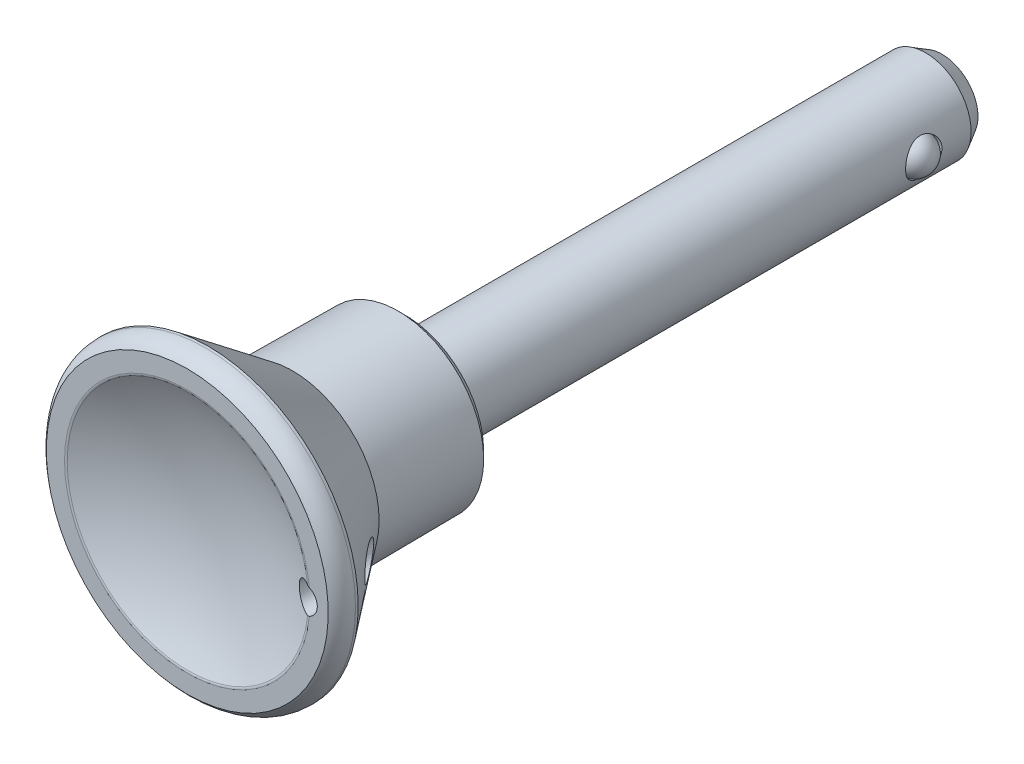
ISO-10303-21;
HEADER;
FILE_DESCRIPTION(('STEP AP214'),'2;1');
FILE_NAME('part.step','',(''),(''),'','','');
FILE_SCHEMA(('AUTOMOTIVE_DESIGN { 1 0 10303 214 1 1 1 1 }'));
ENDSEC;
DATA;
#1=APPLICATION_CONTEXT('core data for automotive mechanical design processes');
#2=APPLICATION_PROTOCOL_DEFINITION('international standard','automotive_design',2000,#1);
#3=PRODUCT_CONTEXT('',#1,'mechanical');
#4=PRODUCT('Part','Part','',(#3));
#5=PRODUCT_RELATED_PRODUCT_CATEGORY('part','',(#4));
#6=PRODUCT_DEFINITION_FORMATION('','',#4);
#7=PRODUCT_DEFINITION_CONTEXT('part definition',#1,'design');
#8=PRODUCT_DEFINITION('design','',#6,#7);
#9=PRODUCT_DEFINITION_SHAPE('','',#8);
#10=(LENGTH_UNIT() NAMED_UNIT(*) SI_UNIT(.MILLI.,.METRE.));
#11=(NAMED_UNIT(*) PLANE_ANGLE_UNIT() SI_UNIT($,.RADIAN.));
#12=(NAMED_UNIT(*) SI_UNIT($,.STERADIAN.) SOLID_ANGLE_UNIT());
#13=UNCERTAINTY_MEASURE_WITH_UNIT(LENGTH_MEASURE(1.E-05),#10,'distance_accuracy_value','');
#14=(GEOMETRIC_REPRESENTATION_CONTEXT(3) GLOBAL_UNCERTAINTY_ASSIGNED_CONTEXT((#13)) GLOBAL_UNIT_ASSIGNED_CONTEXT((#10,
#11,#12)) REPRESENTATION_CONTEXT('',''));
#15=CARTESIAN_POINT('',(0.,0.,0.));
#16=DIRECTION('',(0.,0.,1.));
#17=DIRECTION('',(1.,0.,0.));
#18=AXIS2_PLACEMENT_3D('',#15,#16,#17);
#19=CARTESIAN_POINT('',(0.,0.,23.5));
#20=DIRECTION('',(0.,0.,1.));
#21=DIRECTION('',(0.,-1.,0.));
#22=AXIS2_PLACEMENT_3D('',#19,#20,#21);
#23=TOROIDAL_SURFACE('',#22,13.4996296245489,0.50000000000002);
#24=CARTESIAN_POINT('',(13.1832697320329,1.45020836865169,23.940350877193));
#25=CARTESIAN_POINT('',(13.1967898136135,1.44663630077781,23.9473693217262));
#26=CARTESIAN_POINT('',(13.2105528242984,1.44279517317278,23.9537540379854));
#27=CARTESIAN_POINT('',(13.2384329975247,1.43456873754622,23.9652617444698));
#28=CARTESIAN_POINT('',(13.2525500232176,1.43018363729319,23.9703852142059));
#29=CARTESIAN_POINT('',(13.294658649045,1.41639274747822,23.9836925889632));
#30=CARTESIAN_POINT('',(13.322980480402,1.40620303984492,23.9901034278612));
#31=CARTESIAN_POINT('',(13.3645007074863,1.38980064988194,23.9961744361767));
#32=CARTESIAN_POINT('',(13.377775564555,1.38433480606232,23.9976116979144));
#33=CARTESIAN_POINT('',(13.4043485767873,1.37294329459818,23.9995283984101));
#34=CARTESIAN_POINT('',(13.4176457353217,1.3670137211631,23.999998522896));
#35=CARTESIAN_POINT('',(13.430859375,1.3608881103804,24.));
#36=B_SPLINE_CURVE_WITH_KNOTS('',3,(#24,#25,#26,#27,#28,#29,#30,#31,#32,#33,#34,#35),
.UNSPECIFIED.,.F.,.F.,(4,2,2,2,2,4),(0.,0.0468986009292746,0.0937793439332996,0.185591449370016,
0.228845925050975,0.272515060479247),.UNSPECIFIED.);
#37=CARTESIAN_POINT('',(13.1832697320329,1.45020836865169,23.940350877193));
#38=VERTEX_POINT('',#37);
#39=CARTESIAN_POINT('',(13.430859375,1.36088811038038,24.));
#40=VERTEX_POINT('',#39);
#41=EDGE_CURVE('E60',#38,#40,#36,.T.);
#42=ORIENTED_EDGE('',*,*,#41,.T.);
#43=CARTESIAN_POINT('',(0.,0.,24.));
#44=DIRECTION('',(0.,0.,1.));
#45=DIRECTION('',(0.,-1.,0.));
#46=AXIS2_PLACEMENT_3D('',#43,#44,#45);
#47=CIRCLE('',#46,13.499629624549);
#48=CARTESIAN_POINT('',(13.430859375,-1.36088811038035,24.));
#49=VERTEX_POINT('',#48);
#50=EDGE_CURVE('E39',#49,#40,#47,.F.);
#51=ORIENTED_EDGE('',*,*,#50,.F.);
#52=CARTESIAN_POINT('',(13.430859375,-1.36088811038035,24.));
#53=CARTESIAN_POINT('',(13.4166665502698,-1.36746807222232,23.9999984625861));
#54=CARTESIAN_POINT('',(13.4023759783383,-1.37382175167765,23.9994558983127));
#55=CARTESIAN_POINT('',(13.3736641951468,-1.38605678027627,23.9972288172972));
#56=CARTESIAN_POINT('',(13.3592428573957,-1.39193760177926,23.9955430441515));
#57=CARTESIAN_POINT('',(13.316571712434,-1.4085689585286,23.9887845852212));
#58=CARTESIAN_POINT('',(13.2882736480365,-1.41860415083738,23.9820148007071));
#59=CARTESIAN_POINT('',(13.2473798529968,-1.43179699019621,23.9685266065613));
#60=CARTESIAN_POINT('',(13.2344037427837,-1.43578270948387,23.9636790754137));
#61=CARTESIAN_POINT('',(13.2086362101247,-1.44332889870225,23.9528611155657));
#62=CARTESIAN_POINT('',(13.1958479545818,-1.44688469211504,23.9468798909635));
#63=CARTESIAN_POINT('',(13.1832697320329,-1.45020836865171,23.940350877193));
#64=B_SPLINE_CURVE_WITH_KNOTS('',3,(#52,#53,#54,#55,#56,#57,#58,#59,#60,#61,#62,#63),
.UNSPECIFIED.,.F.,.F.,(4,2,2,2,2,4),(0.,0.0469051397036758,0.0938619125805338,0.185680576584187,
0.228880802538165,0.2725152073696),.UNSPECIFIED.);
#65=CARTESIAN_POINT('',(13.1832697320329,-1.4502083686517,23.940350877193));
#66=VERTEX_POINT('',#65);
#67=EDGE_CURVE('E20',#49,#66,#64,.T.);
#68=ORIENTED_EDGE('',*,*,#67,.T.);
#69=CARTESIAN_POINT('',(0.,0.,23.940350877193));
#70=DIRECTION('',(0.,0.,1.));
#71=DIRECTION('',(0.,-1.,0.));
#72=AXIS2_PLACEMENT_3D('',#69,#70,#71);
#73=CIRCLE('',#72,13.2627940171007);
#74=EDGE_CURVE('E54',#38,#66,#73,.T.);
#75=ORIENTED_EDGE('',*,*,#74,.F.);
#76=EDGE_LOOP('',(#42,#51,#68,#75));
#77=FACE_BOUND('',#76,.T.);
#78=ADVANCED_FACE('F15',(#77),#23,.T.);
#79=CARTESIAN_POINT('',(0.,0.,48.6));
#80=DIRECTION('',(0.,-1.,0.));
#81=DIRECTION('',(0.,0.,1.));
#82=AXIS2_PLACEMENT_3D('',#79,#80,#81);
#83=SPHERICAL_SURFACE('',#82,28.);
#84=CARTESIAN_POINT('',(13.1832697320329,1.45020836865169,23.940350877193));
#85=CARTESIAN_POINT('',(13.0915993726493,1.4744532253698,23.8927620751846));
#86=CARTESIAN_POINT('',(12.9980560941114,1.489860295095,23.8443501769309));
#87=CARTESIAN_POINT('',(12.8097591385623,1.50293318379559,23.7471842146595));
#88=CARTESIAN_POINT('',(12.7150040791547,1.50057651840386,23.6984297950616));
#89=CARTESIAN_POINT('',(12.5270201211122,1.47798913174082,23.6019874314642));
#90=CARTESIAN_POINT('',(12.4337919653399,1.45774995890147,23.5543000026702));
#91=CARTESIAN_POINT('',(12.2517517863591,1.39948117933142,23.4614379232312));
#92=CARTESIAN_POINT('',(12.1629377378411,1.36145981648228,23.416262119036));
#93=CARTESIAN_POINT('',(11.9952411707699,1.26934990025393,23.3311736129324));
#94=CARTESIAN_POINT('',(11.9161458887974,1.21575714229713,23.2911465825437));
#95=CARTESIAN_POINT('',(11.7681643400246,1.09295087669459,23.2164149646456));
#96=CARTESIAN_POINT('',(11.6992729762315,1.02374521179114,23.1817077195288));
#97=CARTESIAN_POINT('',(11.5811025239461,0.878735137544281,23.1222729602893));
#98=CARTESIAN_POINT('',(11.5305709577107,0.804216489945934,23.0969048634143));
#99=CARTESIAN_POINT('',(11.4431131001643,0.645771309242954,23.0530473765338));
#100=CARTESIAN_POINT('',(11.4061726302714,0.561854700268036,23.0345508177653));
#101=CARTESIAN_POINT('',(11.3518094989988,0.398913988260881,23.0073479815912));
#102=CARTESIAN_POINT('',(11.332464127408,0.320688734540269,22.9976766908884));
#103=CARTESIAN_POINT('',(11.3065630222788,0.161638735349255,22.9847305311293));
#104=CARTESIAN_POINT('',(11.3000015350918,0.0808151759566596,22.9814527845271));
#105=CARTESIAN_POINT('',(11.2999985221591,-0.0778011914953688,22.9814513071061));
#106=CARTESIAN_POINT('',(11.3060768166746,-0.155594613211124,22.9844877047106));
#107=CARTESIAN_POINT('',(11.3300927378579,-0.308850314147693,22.9964912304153));
#108=CARTESIAN_POINT('',(11.3480306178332,-0.384312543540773,23.0054584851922));
#109=CARTESIAN_POINT('',(11.3948947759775,-0.530632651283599,23.0289063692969));
#110=CARTESIAN_POINT('',(11.4237977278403,-0.601499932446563,23.0433752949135));
#111=CARTESIAN_POINT('',(11.4913996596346,-0.737094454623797,23.0772561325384));
#112=CARTESIAN_POINT('',(11.5301003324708,-0.801820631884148,23.0966688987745));
#113=CARTESIAN_POINT('',(11.6176766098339,-0.926360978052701,23.1406602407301));
#114=CARTESIAN_POINT('',(11.6669073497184,-0.985860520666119,23.1654195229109));
#115=CARTESIAN_POINT('',(11.7728262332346,-1.09578522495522,23.2187793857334));
#116=CARTESIAN_POINT('',(11.8295165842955,-1.14620769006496,23.2473811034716));
#117=CARTESIAN_POINT('',(11.9547131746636,-1.24189507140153,23.3106654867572));
#118=CARTESIAN_POINT('',(12.0238340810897,-1.28614058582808,23.3456702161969));
#119=CARTESIAN_POINT('',(12.1672246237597,-1.36242212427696,23.4184517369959));
#120=CARTESIAN_POINT('',(12.2414976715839,-1.39444996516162,23.4562303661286));
#121=CARTESIAN_POINT('',(12.3592920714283,-1.4344825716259,23.5162885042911));
#122=CARTESIAN_POINT('',(12.4017101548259,-1.44682505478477,23.5379430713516));
#123=CARTESIAN_POINT('',(12.4872184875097,-1.4676864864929,23.5816530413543));
#124=CARTESIAN_POINT('',(12.5303081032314,-1.47620883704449,23.603708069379));
#125=CARTESIAN_POINT('',(12.6602504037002,-1.49604024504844,23.6703078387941));
#126=CARTESIAN_POINT('',(12.7478240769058,-1.50162964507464,23.7153114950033));
#127=CARTESIAN_POINT('',(12.8938293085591,-1.49821627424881,23.7905484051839));
#128=CARTESIAN_POINT('',(12.9524047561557,-1.49339577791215,23.8207882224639));
#129=CARTESIAN_POINT('',(13.0686394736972,-1.47691090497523,23.8809033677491));
#130=CARTESIAN_POINT('',(13.1263001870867,-1.46525870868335,23.9107792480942));
#131=CARTESIAN_POINT('',(13.1832697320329,-1.4502083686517,23.9403508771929));
#132=B_SPLINE_CURVE_WITH_KNOTS('',3,(#84,#85,#86,#87,#88,#89,#90,#91,#92,#93,#94,#95,#96,#97,
#98,#99,#100,#101,#102,#103,#104,#105,#106,#107,#108,#109,#110,#111,#112,#113,#114,#115,#116,
#117,#118,#119,#120,#121,#122,#123,#124,#125,#126,#127,#128,#129,#130,#131),.UNSPECIFIED.,.F.,
.F.,(4,2,2,2,2,2,2,2,2,2,2,2,2,2,2,2,2,2,2,2,2,2,2,4),(0.,0.317865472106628,0.636133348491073,
0.954551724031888,1.27282262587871,1.58190076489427,1.89082399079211,2.16986616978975,
2.44861641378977,2.69085568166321,2.93298589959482,3.16608592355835,3.39919092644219,
3.63180279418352,3.8644548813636,4.10674626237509,4.34910950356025,4.61569988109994,
4.88246850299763,5.02992533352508,5.17725058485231,5.4717357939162,5.66970066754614,
5.86731365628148),.UNSPECIFIED.);
#133=EDGE_CURVE('E50',#38,#66,#132,.T.);
#134=ORIENTED_EDGE('',*,*,#133,.F.);
#135=ORIENTED_EDGE('',*,*,#74,.T.);
#136=EDGE_LOOP('',(#134,#135));
#137=FACE_BOUND('',#136,.T.);
#138=ADVANCED_FACE('F52',(#137),#83,.F.);
#139=CARTESIAN_POINT('',(-15.81,-15.5,24.));
#140=CARTESIAN_POINT('',(-15.5,-15.5,24.));
#141=CARTESIAN_POINT('',(15.5,-15.5,24.));
#142=B_SPLINE_CURVE_WITH_KNOTS('',1,(#139,#140,#141),.UNSPECIFIED.,.F.,.F.,(2,1,2),(-0.01,0.,
1.),.UNSPECIFIED.);
#143=DIRECTION('',(0.,1.,0.));
#144=VECTOR('',#143,1.);
#145=SURFACE_OF_LINEAR_EXTRUSION('',#142,#144);
#146=CARTESIAN_POINT('',(12.8,0.,24.));
#147=DIRECTION('',(0.,0.,1.));
#148=DIRECTION('',(0.,-1.,0.));
#149=AXIS2_PLACEMENT_3D('',#146,#147,#148);
#150=CIRCLE('',#149,1.5);
#151=EDGE_CURVE('E57',#49,#40,#150,.T.);
#152=ORIENTED_EDGE('',*,*,#151,.F.);
#153=ORIENTED_EDGE('',*,*,#50,.T.);
#154=EDGE_LOOP('',(#152,#153));
#155=FACE_BOUND('',#154,.T.);
#156=CARTESIAN_POINT('',(0.,0.,24.));
#157=DIRECTION('',(0.,0.,1.));
#158=DIRECTION('',(0.,-1.,0.));
#159=AXIS2_PLACEMENT_3D('',#156,#157,#158);
#160=CIRCLE('',#159,15.5);
#161=CARTESIAN_POINT('',(0.,-15.5,24.));
#162=VERTEX_POINT('',#161);
#163=EDGE_CURVE('E58',#162,#162,#160,.F.);
#164=ORIENTED_EDGE('',*,*,#163,.F.);
#165=EDGE_LOOP('',(#164));
#166=FACE_BOUND('',#165,.T.);
#167=ADVANCED_FACE('F192',(#155,#166),#145,.T.);
#168=CARTESIAN_POINT('',(0.,0.,22.));
#169=DIRECTION('',(0.,0.,1.));
#170=DIRECTION('',(0.,-1.,0.));
#171=AXIS2_PLACEMENT_3D('',#168,#169,#170);
#172=TOROIDAL_SURFACE('',#171,14.,2.5);
#173=ORIENTED_EDGE('',*,*,#163,.T.);
#174=EDGE_LOOP('',(#173));
#175=FACE_BOUND('',#174,.T.);
#176=CARTESIAN_POINT('',(0.,0.,22.));
#177=DIRECTION('',(0.,0.,1.));
#178=DIRECTION('',(1.,0.,0.));
#179=AXIS2_PLACEMENT_3D('',#176,#177,#178);
#180=CIRCLE('',#179,16.5);
#181=CARTESIAN_POINT('',(16.5,0.,22.));
#182=VERTEX_POINT('',#181);
#183=EDGE_CURVE('E101',#182,#182,#180,.F.);
#184=ORIENTED_EDGE('',*,*,#183,.F.);
#185=EDGE_LOOP('',(#184));
#186=FACE_BOUND('',#185,.T.);
#187=ADVANCED_FACE('F79',(#175,#186),#172,.T.);
#188=CARTESIAN_POINT('',(12.8,0.,14.7910576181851));
#189=DIRECTION('',(0.,0.,1.));
#190=DIRECTION('',(0.,-1.,0.));
#191=AXIS2_PLACEMENT_3D('',#188,#189,#190);
#192=CYLINDRICAL_SURFACE('',#191,1.5);
#193=CARTESIAN_POINT('',(12.62421875,-1.48966471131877,16.6671130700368));
#194=CARTESIAN_POINT('',(12.6920032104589,-1.49766166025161,16.7577945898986));
#195=CARTESIAN_POINT('',(12.7603283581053,-1.50104579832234,16.8484671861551));
#196=CARTESIAN_POINT('',(12.897645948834,-1.49839397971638,17.0292601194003));
#197=CARTESIAN_POINT('',(12.9666387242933,-1.49235306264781,17.1193801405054));
#198=CARTESIAN_POINT('',(13.1046564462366,-1.47039580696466,17.2982798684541));
#199=CARTESIAN_POINT('',(13.1736813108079,-1.45448817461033,17.3870606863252));
#200=CARTESIAN_POINT('',(13.3110827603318,-1.41207641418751,17.5624849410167));
#201=CARTESIAN_POINT('',(13.3794598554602,-1.38558148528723,17.6491301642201));
#202=CARTESIAN_POINT('',(13.5187485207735,-1.31898430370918,17.8243946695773));
#203=CARTESIAN_POINT('',(13.5895656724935,-1.27816038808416,17.9128199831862));
#204=CARTESIAN_POINT('',(13.7277317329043,-1.18169522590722,18.084148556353));
#205=CARTESIAN_POINT('',(13.7950853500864,-1.12607476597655,18.1670593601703));
#206=CARTESIAN_POINT('',(13.9084086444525,-1.01303116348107,18.3057043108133));
#207=CARTESIAN_POINT('',(13.9556726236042,-0.959133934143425,18.3632332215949));
#208=CARTESIAN_POINT('',(14.0446143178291,-0.840483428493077,18.471045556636));
#209=CARTESIAN_POINT('',(14.0863013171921,-0.775748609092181,18.5213410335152));
#210=CARTESIAN_POINT('',(14.1507925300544,-0.654717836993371,18.5988956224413));
#211=CARTESIAN_POINT('',(14.1756178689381,-0.601120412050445,18.6286642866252));
#212=CARTESIAN_POINT('',(14.2195452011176,-0.488403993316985,18.6812412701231));
#213=CARTESIAN_POINT('',(14.238652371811,-0.429290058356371,18.7040558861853));
#214=CARTESIAN_POINT('',(14.2689681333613,-0.309460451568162,18.7402118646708));
#215=CARTESIAN_POINT('',(14.2805052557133,-0.248950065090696,18.7539474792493));
#216=CARTESIAN_POINT('',(14.2960184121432,-0.12562551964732,18.77240966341));
#217=CARTESIAN_POINT('',(14.3000000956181,-0.0628131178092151,18.7771429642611));
#218=CARTESIAN_POINT('',(14.2999999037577,0.0632231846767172,18.7771427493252));
#219=CARTESIAN_POINT('',(14.2959658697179,0.126447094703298,18.7723472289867));
#220=CARTESIAN_POINT('',(14.2802519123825,0.250551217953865,18.7536458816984));
#221=CARTESIAN_POINT('',(14.2685662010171,0.311429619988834,18.7397331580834));
#222=CARTESIAN_POINT('',(14.2387365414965,0.428564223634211,18.7041556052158));
#223=CARTESIAN_POINT('',(14.2206451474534,0.484853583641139,18.6825538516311));
#224=CARTESIAN_POINT('',(14.1792492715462,0.592453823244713,18.633014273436));
#225=CARTESIAN_POINT('',(14.1559422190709,0.643762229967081,18.6050733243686));
#226=CARTESIAN_POINT('',(14.0931329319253,0.764461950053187,18.5295741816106));
#227=CARTESIAN_POINT('',(14.0512237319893,0.830727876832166,18.4790335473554));
#228=CARTESIAN_POINT('',(13.9615408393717,0.952125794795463,18.370367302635));
#229=CARTESIAN_POINT('',(13.9137529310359,1.00722990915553,18.3122232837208));
#230=CARTESIAN_POINT('',(13.7883270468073,1.13348006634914,18.1588182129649));
#231=CARTESIAN_POINT('',(13.708179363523,1.1978805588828,18.0600849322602));
#232=CARTESIAN_POINT('',(13.5435609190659,1.3064664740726,17.8554996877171));
#233=CARTESIAN_POINT('',(13.4590828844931,1.35061655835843,17.7496356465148));
#234=CARTESIAN_POINT('',(13.3107013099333,1.41202717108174,17.5619635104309));
#235=CARTESIAN_POINT('',(13.2471965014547,1.43330058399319,17.4811068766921));
#236=CARTESIAN_POINT('',(13.1198264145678,1.46698834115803,17.3177942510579));
#237=CARTESIAN_POINT('',(13.0559609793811,1.47939847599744,17.2353375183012));
#238=CARTESIAN_POINT('',(12.9282718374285,1.49589397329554,17.0692879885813));
#239=CARTESIAN_POINT('',(12.8644485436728,1.49996064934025,16.9856930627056));
#240=CARTESIAN_POINT('',(12.7374091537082,1.50003877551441,16.8180712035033));
#241=CARTESIAN_POINT('',(12.6741929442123,1.49605175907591,16.7340443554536));
#242=CARTESIAN_POINT('',(12.5469978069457,1.47993658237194,16.5637117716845));
#243=CARTESIAN_POINT('',(12.4830456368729,1.46758777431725,16.4774068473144));
#244=CARTESIAN_POINT('',(12.3565302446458,1.43443826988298,16.3053467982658));
#245=CARTESIAN_POINT('',(12.2939675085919,1.41363466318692,16.2195918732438));
#246=CARTESIAN_POINT('',(12.1709555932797,1.36334219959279,16.0496685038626));
#247=CARTESIAN_POINT('',(12.1104987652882,1.33388949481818,15.9654949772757));
#248=CARTESIAN_POINT('',(11.9920388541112,1.26565016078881,15.7992974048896));
#249=CARTESIAN_POINT('',(11.9340336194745,1.22687192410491,15.7172714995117));
#250=CARTESIAN_POINT('',(11.8266654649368,1.14315320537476,15.5643050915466));
#251=CARTESIAN_POINT('',(11.7770073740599,1.09916121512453,15.4930561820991));
#252=CARTESIAN_POINT('',(11.6811267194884,1.0014126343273,15.3545942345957));
#253=CARTESIAN_POINT('',(11.6349116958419,0.947635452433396,15.2873901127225));
#254=CARTESIAN_POINT('',(11.5691423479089,0.858125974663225,15.1911821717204));
#255=CARTESIAN_POINT('',(11.5476572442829,0.826531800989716,15.1596504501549));
#256=CARTESIAN_POINT('',(11.5063433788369,0.760253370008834,15.0988444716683));
#257=CARTESIAN_POINT('',(11.4865152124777,0.725568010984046,15.0695710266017));
#258=CARTESIAN_POINT('',(11.4302732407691,0.616814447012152,14.9863165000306));
#259=CARTESIAN_POINT('',(11.3967954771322,0.537651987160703,14.9364517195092));
#260=CARTESIAN_POINT('',(11.3555291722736,0.407099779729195,14.8747804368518));
#261=CARTESIAN_POINT('',(11.3430899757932,0.360365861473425,14.856144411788));
#262=CARTESIAN_POINT('',(11.3225831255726,0.263914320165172,14.8253840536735));
#263=CARTESIAN_POINT('',(11.3145046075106,0.214204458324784,14.8132435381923));
#264=CARTESIAN_POINT('',(11.3059949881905,0.136701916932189,14.8004485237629));
#265=CARTESIAN_POINT('',(11.3037543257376,0.109528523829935,14.7970776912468));
#266=CARTESIAN_POINT('',(11.300755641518,0.0549082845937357,14.7925658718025));
#267=CARTESIAN_POINT('',(11.2999979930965,0.0274613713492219,14.791425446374));
#268=CARTESIAN_POINT('',(11.3000036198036,-0.049531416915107,14.7914342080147));
#269=CARTESIAN_POINT('',(11.3024785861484,-0.0991098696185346,14.7951600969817));
#270=CARTESIAN_POINT('',(11.3121472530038,-0.196763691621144,14.8096998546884));
#271=CARTESIAN_POINT('',(11.3193489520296,-0.244836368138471,14.8205257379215));
#272=CARTESIAN_POINT('',(11.3399096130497,-0.348584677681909,14.8513795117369));
#273=CARTESIAN_POINT('',(11.3542736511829,-0.403610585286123,14.872906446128));
#274=CARTESIAN_POINT('',(11.387815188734,-0.508718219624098,14.9230284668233));
#275=CARTESIAN_POINT('',(11.4070004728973,-0.558791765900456,14.9516349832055));
#276=CARTESIAN_POINT('',(11.4595328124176,-0.677671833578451,15.0296959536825));
#277=CARTESIAN_POINT('',(11.4951602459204,-0.743300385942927,15.0824162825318));
#278=CARTESIAN_POINT('',(11.5718624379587,-0.864190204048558,15.1952386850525));
#279=CARTESIAN_POINT('',(11.6129512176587,-0.919423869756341,15.2553597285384));
#280=CARTESIAN_POINT('',(11.6921657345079,-1.01283475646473,15.3705343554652));
#281=CARTESIAN_POINT('',(11.7297508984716,-1.05232856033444,15.4249113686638));
#282=CARTESIAN_POINT('',(11.8070065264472,-1.12552131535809,15.5360737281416));
#283=CARTESIAN_POINT('',(11.8466784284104,-1.15921620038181,15.5928607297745));
#284=CARTESIAN_POINT('',(11.9276586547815,-1.22132048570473,15.7081342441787));
#285=CARTESIAN_POINT('',(11.9689673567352,-1.24972865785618,15.7666211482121));
#286=CARTESIAN_POINT('',(12.0529136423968,-1.30165144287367,15.884812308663));
#287=CARTESIAN_POINT('',(12.0955516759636,-1.32516437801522,15.9445169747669));
#288=CARTESIAN_POINT('',(12.2167649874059,-1.38470455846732,16.1132939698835));
#289=CARTESIAN_POINT('',(12.2965837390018,-1.41552588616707,16.2233378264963));
#290=CARTESIAN_POINT('',(12.458735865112,-1.46310486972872,16.4446295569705));
#291=CARTESIAN_POINT('',(12.5410705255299,-1.47985520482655,16.5558780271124));
#292=CARTESIAN_POINT('',(12.62421875,-1.48966471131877,16.6671130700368));
#293=B_SPLINE_CURVE_WITH_KNOTS('',3,(#193,#194,#195,#196,#197,#198,#199,#200,#201,#202,#203,
#204,#205,#206,#207,#208,#209,#210,#211,#212,#213,#214,#215,#216,#217,#218,#219,#220,#221,#222,
#223,#224,#225,#226,#227,#228,#229,#230,#231,#232,#233,#234,#235,#236,#237,#238,#239,#240,#241,
#242,#243,#244,#245,#246,#247,#248,#249,#250,#251,#252,#253,#254,#255,#256,#257,#258,#259,#260,
#261,#262,#263,#264,#265,#266,#267,#268,#269,#270,#271,#272,#273,#274,#275,#276,#277,#278,#279,
#280,#281,#282,#283,#284,#285,#286,#287,#288,#289,#290,#291,#292),.UNSPECIFIED.,.T.,.F.,(4,2,2,
2,2,2,2,2,2,2,2,2,2,2,2,2,2,2,2,2,2,2,2,2,2,2,2,2,2,2,2,2,2,2,2,2,2,2,2,2,2,2,2,2,2,2,2,2,2,4),
(0.,0.3403810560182,0.680941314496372,1.02120149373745,1.36116666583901,1.72154948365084,
2.08142867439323,2.35634247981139,2.63079277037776,2.82853330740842,3.02609425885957,
3.21438583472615,3.40253656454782,3.59191561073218,3.78143807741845,3.96944036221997,
4.15753551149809,4.43581804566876,4.71478725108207,5.14007838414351,5.56610888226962,
5.88069336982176,6.19542716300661,6.51086508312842,6.82624294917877,7.15028500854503,
7.47443870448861,7.79725631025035,8.11978447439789,8.41136093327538,8.70355821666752,
8.8520054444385,9.00050579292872,9.29551066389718,9.45047012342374,9.60504170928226,
9.6873437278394,9.76966646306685,9.91815000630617,10.0668854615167,10.2482950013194,
10.4299993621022,10.7027068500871,10.9761285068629,11.2068168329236,11.4376662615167,
11.6685692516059,11.8995512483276,12.3168647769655,12.7343952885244),.UNSPECIFIED.);
#294=CARTESIAN_POINT('',(12.62421875,-1.48966471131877,16.6671130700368));
#295=VERTEX_POINT('',#294);
#296=EDGE_CURVE('E93',#295,#295,#293,.T.);
#297=ORIENTED_EDGE('',*,*,#296,.F.);
#298=EDGE_LOOP('',(#297));
#299=FACE_BOUND('',#298,.T.);
#300=ORIENTED_EDGE('',*,*,#67,.F.);
#301=ORIENTED_EDGE('',*,*,#151,.T.);
#302=ORIENTED_EDGE('',*,*,#41,.F.);
#303=ORIENTED_EDGE('',*,*,#133,.T.);
#304=EDGE_LOOP('',(#300,#301,#302,#303));
#305=FACE_BOUND('',#304,.T.);
#306=ADVANCED_FACE('F61',(#299,#305),#192,.F.);
#307=CARTESIAN_POINT('',(0.,0.,22.));
#308=DIRECTION('',(0.,0.,1.));
#309=DIRECTION('',(0.,-1.,0.));
#310=AXIS2_PLACEMENT_3D('',#307,#308,#309);
#311=CYLINDRICAL_SURFACE('',#310,16.5);
#312=ORIENTED_EDGE('',*,*,#183,.T.);
#313=EDGE_LOOP('',(#312));
#314=FACE_BOUND('',#313,.T.);
#315=CARTESIAN_POINT('',(0.,0.,21.7));
#316=DIRECTION('',(0.,0.,-1.));
#317=DIRECTION('',(1.,0.,0.));
#318=AXIS2_PLACEMENT_3D('',#315,#316,#317);
#319=CIRCLE('',#318,16.5);
#320=CARTESIAN_POINT('',(16.5,0.,21.7));
#321=VERTEX_POINT('',#320);
#322=EDGE_CURVE('E100',#321,#321,#319,.T.);
#323=ORIENTED_EDGE('',*,*,#322,.F.);
#324=EDGE_LOOP('',(#323));
#325=FACE_BOUND('',#324,.T.);
#326=ADVANCED_FACE('F78',(#314,#325),#311,.T.);
#327=CARTESIAN_POINT('',(0.,0.,12.4));
#328=DIRECTION('',(0.,0.,1.));
#329=DIRECTION('',(0.,-1.,0.));
#330=AXIS2_PLACEMENT_3D('',#327,#328,#329);
#331=CONICAL_SURFACE('',#330,9.5,0.645219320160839);
#332=ORIENTED_EDGE('',*,*,#296,.T.);
#333=EDGE_LOOP('',(#332));
#334=FACE_BOUND('',#333,.T.);
#335=ORIENTED_EDGE('',*,*,#322,.T.);
#336=EDGE_LOOP('',(#335));
#337=FACE_BOUND('',#336,.T.);
#338=CARTESIAN_POINT('',(0.,0.,12.4));
#339=DIRECTION('',(0.,0.,-1.));
#340=DIRECTION('',(1.,0.,0.));
#341=AXIS2_PLACEMENT_3D('',#338,#339,#340);
#342=CIRCLE('',#341,9.5);
#343=CARTESIAN_POINT('',(9.5,0.,12.4));
#344=VERTEX_POINT('',#343);
#345=EDGE_CURVE('E173',#344,#344,#342,.T.);
#346=ORIENTED_EDGE('',*,*,#345,.F.);
#347=EDGE_LOOP('',(#346));
#348=FACE_BOUND('',#347,.T.);
#349=ADVANCED_FACE('F102',(#334,#337,#348),#331,.T.);
#350=CARTESIAN_POINT('',(0.,0.,0.799969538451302));
#351=DIRECTION('',(0.,0.,1.));
#352=DIRECTION('',(0.,-1.,0.));
#353=AXIS2_PLACEMENT_3D('',#350,#351,#352);
#354=CONICAL_SURFACE('',#353,9.39876806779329,0.00872664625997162);
#355=ORIENTED_EDGE('',*,*,#345,.T.);
#356=EDGE_LOOP('',(#355));
#357=FACE_BOUND('',#356,.T.);
#358=CARTESIAN_POINT('',(0.,0.,0.799969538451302));
#359=DIRECTION('',(0.,0.,-1.));
#360=DIRECTION('',(1.,0.,0.));
#361=AXIS2_PLACEMENT_3D('',#358,#359,#360);
#362=CIRCLE('',#361,9.39876806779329);
#363=CARTESIAN_POINT('',(9.39876806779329,0.,0.799969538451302));
#364=VERTEX_POINT('',#363);
#365=EDGE_CURVE('E169',#364,#364,#362,.T.);
#366=ORIENTED_EDGE('',*,*,#365,.F.);
#367=EDGE_LOOP('',(#366));
#368=FACE_BOUND('',#367,.T.);
#369=ADVANCED_FACE('F106',(#357,#368),#354,.T.);
#370=CARTESIAN_POINT('',(0.,0.,0.));
#371=DIRECTION('',(0.,0.,1.));
#372=DIRECTION('',(0.,-1.,0.));
#373=AXIS2_PLACEMENT_3D('',#370,#371,#372);
#374=CONICAL_SURFACE('',#373,8.59178683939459,0.789761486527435);
#375=ORIENTED_EDGE('',*,*,#365,.T.);
#376=EDGE_LOOP('',(#375));
#377=FACE_BOUND('',#376,.T.);
#378=CARTESIAN_POINT('',(0.,0.,0.));
#379=DIRECTION('',(0.,0.,1.));
#380=DIRECTION('',(0.,-1.,0.));
#381=AXIS2_PLACEMENT_3D('',#378,#379,#380);
#382=CIRCLE('',#381,8.59178683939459);
#383=CARTESIAN_POINT('',(0.,-8.59178683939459,0.));
#384=VERTEX_POINT('',#383);
#385=EDGE_CURVE('E32',#384,#384,#382,.F.);
#386=ORIENTED_EDGE('',*,*,#385,.F.);
#387=EDGE_LOOP('',(#386));
#388=FACE_BOUND('',#387,.T.);
#389=ADVANCED_FACE('F110',(#377,#388),#374,.T.);
#390=CARTESIAN_POINT('',(8.5917868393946,-8.69489038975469,0.));
#391=DIRECTION('',(0.,0.,-1.));
#392=DIRECTION('',(-1.,0.,0.));
#393=AXIS2_PLACEMENT_3D('',#390,#391,#392);
#394=PLANE('',#393);
#395=CARTESIAN_POINT('',(0.,0.,0.));
#396=DIRECTION('',(0.,0.,1.));
#397=DIRECTION('',(0.,-1.,0.));
#398=AXIS2_PLACEMENT_3D('',#395,#396,#397);
#399=CIRCLE('',#398,5.);
#400=CARTESIAN_POINT('',(0.,-5.,0.));
#401=VERTEX_POINT('',#400);
#402=EDGE_CURVE('E9',#401,#401,#399,.F.);
#403=ORIENTED_EDGE('',*,*,#402,.F.);
#404=EDGE_LOOP('',(#403));
#405=FACE_BOUND('',#404,.T.);
#406=ORIENTED_EDGE('',*,*,#385,.T.);
#407=EDGE_LOOP('',(#406));
#408=FACE_BOUND('',#407,.T.);
#409=ADVANCED_FACE('F114',(#405,#408),#394,.T.);
#410=CARTESIAN_POINT('',(0.,0.,0.));
#411=DIRECTION('',(0.,0.,1.));
#412=DIRECTION('',(0.,-1.,0.));
#413=AXIS2_PLACEMENT_3D('',#410,#411,#412);
#414=CYLINDRICAL_SURFACE('',#413,5.);
#415=ORIENTED_EDGE('',*,*,#402,.T.);
#416=EDGE_LOOP('',(#415));
#417=FACE_BOUND('',#416,.T.);
#418=CARTESIAN_POINT('',(5.,0.,-50.));
#419=CARTESIAN_POINT('',(4.99999504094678,0.107615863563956,-50.0000062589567));
#420=CARTESIAN_POINT('',(4.99648897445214,0.215325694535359,-50.0087281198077));
#421=CARTESIAN_POINT('',(4.98282088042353,0.42761671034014,-50.0432818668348));
#422=CARTESIAN_POINT('',(4.97264930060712,0.532193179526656,-50.0691383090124));
#423=CARTESIAN_POINT('',(4.94674442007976,0.734940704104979,-50.1368701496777));
#424=CARTESIAN_POINT('',(4.93102668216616,0.833128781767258,-50.1787007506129));
#425=CARTESIAN_POINT('',(4.89557266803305,1.0210409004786,-50.2770003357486));
#426=CARTESIAN_POINT('',(4.87583644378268,1.11076505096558,-50.3334691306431));
#427=CARTESIAN_POINT('',(4.83330802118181,1.28350477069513,-50.4622380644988));
#428=CARTESIAN_POINT('',(4.8104211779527,1.36606882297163,-50.5351123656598));
#429=CARTESIAN_POINT('',(4.76460397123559,1.51818036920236,-50.6934066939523));
#430=CARTESIAN_POINT('',(4.74167359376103,1.58772251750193,-50.7788318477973));
#431=CARTESIAN_POINT('',(4.69722807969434,1.71487412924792,-50.9644273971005));
#432=CARTESIAN_POINT('',(4.67582146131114,1.77181418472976,-51.0650850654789));
#433=CARTESIAN_POINT('',(4.63833669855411,1.86775416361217,-51.2755348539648));
#434=CARTESIAN_POINT('',(4.62225609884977,1.90676235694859,-51.3853227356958));
#435=CARTESIAN_POINT('',(4.59826357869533,1.9638988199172,-51.6057123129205));
#436=CARTESIAN_POINT('',(4.59001420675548,1.9828939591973,-51.7160511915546));
#437=CARTESIAN_POINT('',(4.58164004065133,2.00217296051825,-51.9386349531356));
#438=CARTESIAN_POINT('',(4.5815112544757,2.00246601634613,-52.0508788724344));
#439=CARTESIAN_POINT('',(4.58910500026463,1.98498937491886,-52.2657566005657));
#440=CARTESIAN_POINT('',(4.59628174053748,1.96847534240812,-52.3685155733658));
#441=CARTESIAN_POINT('',(4.61676185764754,1.91994691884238,-52.5696594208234));
#442=CARTESIAN_POINT('',(4.63006631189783,1.88792980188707,-52.6680435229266));
#443=CARTESIAN_POINT('',(4.66159517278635,1.80869394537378,-52.8600197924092));
#444=CARTESIAN_POINT('',(4.67991453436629,1.76117802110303,-52.9534730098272));
#445=CARTESIAN_POINT('',(4.71938201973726,1.65250390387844,-53.1314192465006));
#446=CARTESIAN_POINT('',(4.74053109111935,1.59134113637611,-53.2159092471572));
#447=CARTESIAN_POINT('',(4.78526406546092,1.45156124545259,-53.3803975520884));
#448=CARTESIAN_POINT('',(4.80890991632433,1.37196139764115,-53.4595460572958));
#449=CARTESIAN_POINT('',(4.85459194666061,1.20033946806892,-53.6036660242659));
#450=CARTESIAN_POINT('',(4.87662734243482,1.10831139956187,-53.668630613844));
#451=CARTESIAN_POINT('',(4.91716230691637,0.912007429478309,-53.7836609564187));
#452=CARTESIAN_POINT('',(4.93558065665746,0.80752012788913,-53.8333960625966));
#453=CARTESIAN_POINT('',(4.96616672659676,0.590835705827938,-53.914216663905));
#454=CARTESIAN_POINT('',(4.97834697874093,0.478654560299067,-53.9453395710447));
#455=CARTESIAN_POINT('',(4.99108567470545,0.304486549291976,-53.977631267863));
#456=CARTESIAN_POINT('',(4.99441629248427,0.243952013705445,-53.9860060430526));
#457=CARTESIAN_POINT('',(4.99887485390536,0.122288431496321,-53.9971921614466));
#458=CARTESIAN_POINT('',(5.00000281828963,0.0611593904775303,-54.0000035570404));
#459=CARTESIAN_POINT('',(4.99999504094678,-0.107615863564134,-53.9999937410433));
#460=CARTESIAN_POINT('',(4.99648897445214,-0.215325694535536,-53.9912718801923));
#461=CARTESIAN_POINT('',(4.98282088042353,-0.427616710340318,-53.9567181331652));
#462=CARTESIAN_POINT('',(4.97264930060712,-0.532193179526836,-53.9308616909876));
#463=CARTESIAN_POINT('',(4.94674442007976,-0.734940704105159,-53.8631298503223));
#464=CARTESIAN_POINT('',(4.93102668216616,-0.833128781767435,-53.8212992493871));
#465=CARTESIAN_POINT('',(4.89557266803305,-1.02104090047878,-53.7229996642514));
#466=CARTESIAN_POINT('',(4.87583644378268,-1.11076505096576,-53.6665308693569));
#467=CARTESIAN_POINT('',(4.83330802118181,-1.28350477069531,-53.5377619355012));
#468=CARTESIAN_POINT('',(4.81042117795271,-1.3660688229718,-53.4648876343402));
#469=CARTESIAN_POINT('',(4.76460397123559,-1.51818036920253,-53.3065933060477));
#470=CARTESIAN_POINT('',(4.74167359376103,-1.58772251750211,-53.2211681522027));
#471=CARTESIAN_POINT('',(4.69722807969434,-1.7148741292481,-53.0355726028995));
#472=CARTESIAN_POINT('',(4.67582146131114,-1.77181418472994,-52.9349149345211));
#473=CARTESIAN_POINT('',(4.63833669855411,-1.86775416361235,-52.7244651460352));
#474=CARTESIAN_POINT('',(4.62225609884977,-1.90676235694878,-52.6146772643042));
#475=CARTESIAN_POINT('',(4.59826357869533,-1.96389881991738,-52.3942876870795));
#476=CARTESIAN_POINT('',(4.59001420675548,-1.98289395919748,-52.2839488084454));
#477=CARTESIAN_POINT('',(4.58164004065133,-2.00217296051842,-52.0613650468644));
#478=CARTESIAN_POINT('',(4.5815112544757,-2.0024660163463,-51.9491211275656));
#479=CARTESIAN_POINT('',(4.58910500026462,-1.98498937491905,-51.7342433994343));
#480=CARTESIAN_POINT('',(4.59628174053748,-1.96847534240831,-51.6314844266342));
#481=CARTESIAN_POINT('',(4.61676185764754,-1.91994691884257,-51.4303405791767));
#482=CARTESIAN_POINT('',(4.63006631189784,-1.88792980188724,-51.3319564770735));
#483=CARTESIAN_POINT('',(4.66159517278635,-1.80869394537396,-51.1399802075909));
#484=CARTESIAN_POINT('',(4.67991453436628,-1.76117802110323,-51.0465269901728));
#485=CARTESIAN_POINT('',(4.71938201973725,-1.65250390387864,-50.8685807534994));
#486=CARTESIAN_POINT('',(4.74053109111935,-1.5913411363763,-50.7840907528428));
#487=CARTESIAN_POINT('',(4.78526406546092,-1.45156124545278,-50.6196024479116));
#488=CARTESIAN_POINT('',(4.80890991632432,-1.37196139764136,-50.5404539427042));
#489=CARTESIAN_POINT('',(4.8545919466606,-1.20033946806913,-50.3963339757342));
#490=CARTESIAN_POINT('',(4.87662734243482,-1.10831139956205,-50.3313693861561));
#491=CARTESIAN_POINT('',(4.91716230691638,-0.912007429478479,-50.2163390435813));
#492=CARTESIAN_POINT('',(4.93558065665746,-0.80752012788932,-50.1666039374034));
#493=CARTESIAN_POINT('',(4.96616672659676,-0.590835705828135,-50.0857833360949));
#494=CARTESIAN_POINT('',(4.97834697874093,-0.478654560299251,-50.0546604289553));
#495=CARTESIAN_POINT('',(4.99108567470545,-0.304486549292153,-50.022368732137));
#496=CARTESIAN_POINT('',(4.99441629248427,-0.243952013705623,-50.0139939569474));
#497=CARTESIAN_POINT('',(4.99887485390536,-0.122288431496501,-50.0028078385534));
#498=CARTESIAN_POINT('',(5.00000281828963,-0.0611593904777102,-49.9999964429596));
#499=CARTESIAN_POINT('',(5.,0.,-50.));
#500=B_SPLINE_CURVE_WITH_KNOTS('',3,(#418,#419,#420,#421,#422,#423,#424,#425,#426,#427,#428,
#429,#430,#431,#432,#433,#434,#435,#436,#437,#438,#439,#440,#441,#442,#443,#444,#445,#446,#447,
#448,#449,#450,#451,#452,#453,#454,#455,#456,#457,#458,#459,#460,#461,#462,#463,#464,#465,#466,
#467,#468,#469,#470,#471,#472,#473,#474,#475,#476,#477,#478,#479,#480,#481,#482,#483,#484,#485,
#486,#487,#488,#489,#490,#491,#492,#493,#494,#495,#496,#497,#498,#499),.UNSPECIFIED.,.T.,.F.,(4,
2,2,2,2,2,2,2,2,2,2,2,2,2,2,2,2,2,2,2,2,2,2,2,2,2,2,2,2,2,2,2,2,2,2,2,2,2,2,2,4),(0.,
0.322610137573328,0.645683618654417,0.967857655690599,1.29002752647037,1.62598692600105,
1.9620839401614,2.31315011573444,2.6640542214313,2.99904097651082,3.33386305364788,
3.6453830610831,3.9569578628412,4.27489766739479,4.59294420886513,4.93553475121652,
5.27829091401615,5.62803295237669,5.97706959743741,6.16041454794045,6.34375777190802,
6.66636790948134,6.98944139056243,7.31161542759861,7.63378529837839,7.96974469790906,
8.30584171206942,8.65690788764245,9.00781199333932,9.34279874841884,9.6776208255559,
9.98914083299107,10.3007156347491,10.6186554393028,10.9367019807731,11.2792925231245,
11.6220486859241,11.9717907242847,12.3208273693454,12.5041723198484,12.687515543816),.UNSPECIFIED.);
#501=CARTESIAN_POINT('',(5.,0.,-50.));
#502=VERTEX_POINT('',#501);
#503=EDGE_CURVE('E131',#502,#502,#500,.T.);
#504=ORIENTED_EDGE('',*,*,#503,.T.);
#505=EDGE_LOOP('',(#504));
#506=FACE_BOUND('',#505,.T.);
#507=CARTESIAN_POINT('',(-5.,0.,-50.));
#508=CARTESIAN_POINT('',(-4.99999504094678,0.107615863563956,-50.0000062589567));
#509=CARTESIAN_POINT('',(-4.99648897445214,0.215325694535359,-50.0087281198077));
#510=CARTESIAN_POINT('',(-4.98282088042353,0.427616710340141,-50.0432818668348));
#511=CARTESIAN_POINT('',(-4.97264930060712,0.532193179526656,-50.0691383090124));
#512=CARTESIAN_POINT('',(-4.94674442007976,0.734940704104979,-50.1368701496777));
#513=CARTESIAN_POINT('',(-4.93102668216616,0.833128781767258,-50.1787007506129));
#514=CARTESIAN_POINT('',(-4.89557266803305,1.0210409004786,-50.2770003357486));
#515=CARTESIAN_POINT('',(-4.87583644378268,1.11076505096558,-50.3334691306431));
#516=CARTESIAN_POINT('',(-4.83330802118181,1.28350477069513,-50.4622380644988));
#517=CARTESIAN_POINT('',(-4.8104211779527,1.36606882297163,-50.5351123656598));
#518=CARTESIAN_POINT('',(-4.76460397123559,1.51818036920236,-50.6934066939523));
#519=CARTESIAN_POINT('',(-4.74167359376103,1.58772251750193,-50.7788318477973));
#520=CARTESIAN_POINT('',(-4.69722807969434,1.71487412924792,-50.9644273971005));
#521=CARTESIAN_POINT('',(-4.67582146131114,1.77181418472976,-51.0650850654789));
#522=CARTESIAN_POINT('',(-4.63833669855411,1.86775416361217,-51.2755348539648));
#523=CARTESIAN_POINT('',(-4.62225609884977,1.90676235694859,-51.3853227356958));
#524=CARTESIAN_POINT('',(-4.59826357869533,1.9638988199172,-51.6057123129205));
#525=CARTESIAN_POINT('',(-4.59001420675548,1.9828939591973,-51.7160511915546));
#526=CARTESIAN_POINT('',(-4.58164004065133,2.00217296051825,-51.9386349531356));
#527=CARTESIAN_POINT('',(-4.5815112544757,2.00246601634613,-52.0508788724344));
#528=CARTESIAN_POINT('',(-4.58910500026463,1.98498937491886,-52.2657566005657));
#529=CARTESIAN_POINT('',(-4.59628174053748,1.96847534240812,-52.3685155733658));
#530=CARTESIAN_POINT('',(-4.61676185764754,1.91994691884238,-52.5696594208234));
#531=CARTESIAN_POINT('',(-4.63006631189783,1.88792980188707,-52.6680435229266));
#532=CARTESIAN_POINT('',(-4.66159517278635,1.80869394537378,-52.8600197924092));
#533=CARTESIAN_POINT('',(-4.67991453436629,1.76117802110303,-52.9534730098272));
#534=CARTESIAN_POINT('',(-4.71938201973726,1.65250390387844,-53.1314192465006));
#535=CARTESIAN_POINT('',(-4.74053109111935,1.59134113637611,-53.2159092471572));
#536=CARTESIAN_POINT('',(-4.78526406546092,1.45156124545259,-53.3803975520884));
#537=CARTESIAN_POINT('',(-4.80890991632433,1.37196139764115,-53.4595460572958));
#538=CARTESIAN_POINT('',(-4.85459194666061,1.20033946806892,-53.6036660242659));
#539=CARTESIAN_POINT('',(-4.87662734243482,1.10831139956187,-53.668630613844));
#540=CARTESIAN_POINT('',(-4.91716230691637,0.912007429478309,-53.7836609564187));
#541=CARTESIAN_POINT('',(-4.93558065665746,0.80752012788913,-53.8333960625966));
#542=CARTESIAN_POINT('',(-4.96616672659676,0.590835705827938,-53.914216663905));
#543=CARTESIAN_POINT('',(-4.97834697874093,0.478654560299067,-53.9453395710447));
#544=CARTESIAN_POINT('',(-4.99108567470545,0.304486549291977,-53.977631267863));
#545=CARTESIAN_POINT('',(-4.99441629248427,0.243952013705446,-53.9860060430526));
#546=CARTESIAN_POINT('',(-4.99887485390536,0.122288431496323,-53.9971921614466));
#547=CARTESIAN_POINT('',(-5.00000281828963,0.0611593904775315,-54.0000035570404));
#548=CARTESIAN_POINT('',(-4.99999504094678,-0.107615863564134,-53.9999937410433));
#549=CARTESIAN_POINT('',(-4.99648897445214,-0.215325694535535,-53.9912718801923));
#550=CARTESIAN_POINT('',(-4.98282088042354,-0.427616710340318,-53.9567181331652));
#551=CARTESIAN_POINT('',(-4.97264930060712,-0.532193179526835,-53.9308616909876));
#552=CARTESIAN_POINT('',(-4.94674442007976,-0.734940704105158,-53.8631298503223));
#553=CARTESIAN_POINT('',(-4.93102668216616,-0.833128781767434,-53.8212992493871));
#554=CARTESIAN_POINT('',(-4.89557266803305,-1.02104090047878,-53.7229996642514));
#555=CARTESIAN_POINT('',(-4.87583644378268,-1.11076505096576,-53.6665308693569));
#556=CARTESIAN_POINT('',(-4.83330802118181,-1.28350477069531,-53.5377619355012));
#557=CARTESIAN_POINT('',(-4.81042117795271,-1.3660688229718,-53.4648876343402));
#558=CARTESIAN_POINT('',(-4.76460397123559,-1.51818036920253,-53.3065933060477));
#559=CARTESIAN_POINT('',(-4.74167359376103,-1.58772251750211,-53.2211681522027));
#560=CARTESIAN_POINT('',(-4.69722807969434,-1.7148741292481,-53.0355726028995));
#561=CARTESIAN_POINT('',(-4.67582146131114,-1.77181418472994,-52.9349149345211));
#562=CARTESIAN_POINT('',(-4.63833669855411,-1.86775416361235,-52.7244651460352));
#563=CARTESIAN_POINT('',(-4.62225609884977,-1.90676235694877,-52.6146772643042));
#564=CARTESIAN_POINT('',(-4.59826357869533,-1.96389881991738,-52.3942876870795));
#565=CARTESIAN_POINT('',(-4.59001420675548,-1.98289395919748,-52.2839488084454));
#566=CARTESIAN_POINT('',(-4.58164004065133,-2.00217296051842,-52.0613650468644));
#567=CARTESIAN_POINT('',(-4.5815112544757,-2.0024660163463,-51.9491211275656));
#568=CARTESIAN_POINT('',(-4.58910500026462,-1.98498937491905,-51.7342433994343));
#569=CARTESIAN_POINT('',(-4.59628174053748,-1.96847534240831,-51.6314844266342));
#570=CARTESIAN_POINT('',(-4.61676185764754,-1.91994691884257,-51.4303405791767));
#571=CARTESIAN_POINT('',(-4.63006631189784,-1.88792980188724,-51.3319564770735));
#572=CARTESIAN_POINT('',(-4.66159517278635,-1.80869394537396,-51.1399802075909));
#573=CARTESIAN_POINT('',(-4.67991453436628,-1.76117802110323,-51.0465269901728));
#574=CARTESIAN_POINT('',(-4.71938201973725,-1.65250390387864,-50.8685807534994));
#575=CARTESIAN_POINT('',(-4.74053109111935,-1.5913411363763,-50.7840907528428));
#576=CARTESIAN_POINT('',(-4.78526406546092,-1.45156124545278,-50.6196024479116));
#577=CARTESIAN_POINT('',(-4.80890991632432,-1.37196139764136,-50.5404539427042));
#578=CARTESIAN_POINT('',(-4.8545919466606,-1.20033946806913,-50.3963339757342));
#579=CARTESIAN_POINT('',(-4.87662734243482,-1.10831139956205,-50.3313693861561));
#580=CARTESIAN_POINT('',(-4.91716230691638,-0.912007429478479,-50.2163390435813));
#581=CARTESIAN_POINT('',(-4.93558065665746,-0.807520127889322,-50.1666039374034));
#582=CARTESIAN_POINT('',(-4.96616672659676,-0.590835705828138,-50.0857833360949));
#583=CARTESIAN_POINT('',(-4.97834697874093,-0.478654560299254,-50.0546604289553));
#584=CARTESIAN_POINT('',(-4.99108567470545,-0.304486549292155,-50.022368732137));
#585=CARTESIAN_POINT('',(-4.99441629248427,-0.243952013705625,-50.0139939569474));
#586=CARTESIAN_POINT('',(-4.99887485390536,-0.122288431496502,-50.0028078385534));
#587=CARTESIAN_POINT('',(-5.00000281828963,-0.0611593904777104,-49.9999964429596));
#588=CARTESIAN_POINT('',(-5.,0.,-50.));
#589=B_SPLINE_CURVE_WITH_KNOTS('',3,(#507,#508,#509,#510,#511,#512,#513,#514,#515,#516,#517,
#518,#519,#520,#521,#522,#523,#524,#525,#526,#527,#528,#529,#530,#531,#532,#533,#534,#535,#536,
#537,#538,#539,#540,#541,#542,#543,#544,#545,#546,#547,#548,#549,#550,#551,#552,#553,#554,#555,
#556,#557,#558,#559,#560,#561,#562,#563,#564,#565,#566,#567,#568,#569,#570,#571,#572,#573,#574,
#575,#576,#577,#578,#579,#580,#581,#582,#583,#584,#585,#586,#587,#588),.UNSPECIFIED.,.T.,.F.,(4,
2,2,2,2,2,2,2,2,2,2,2,2,2,2,2,2,2,2,2,2,2,2,2,2,2,2,2,2,2,2,2,2,2,2,2,2,2,2,2,4),(0.,
0.322610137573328,0.645683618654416,0.967857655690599,1.29002752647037,1.62598692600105,
1.9620839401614,2.31315011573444,2.6640542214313,2.99904097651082,3.33386305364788,
3.6453830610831,3.9569578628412,4.27489766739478,4.59294420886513,4.93553475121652,
5.27829091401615,5.62803295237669,5.97706959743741,6.16041454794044,6.34375777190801,
6.66636790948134,6.98944139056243,7.31161542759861,7.63378529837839,7.96974469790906,
8.30584171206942,8.65690788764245,9.00781199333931,9.34279874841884,9.6776208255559,
9.98914083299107,10.3007156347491,10.6186554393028,10.9367019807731,11.2792925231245,
11.6220486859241,11.9717907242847,12.3208273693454,12.5041723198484,12.687515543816),.UNSPECIFIED.);
#590=CARTESIAN_POINT('',(-5.,0.,-50.));
#591=VERTEX_POINT('',#590);
#592=EDGE_CURVE('E139',#591,#591,#589,.T.);
#593=ORIENTED_EDGE('',*,*,#592,.F.);
#594=EDGE_LOOP('',(#593));
#595=FACE_BOUND('',#594,.T.);
#596=CARTESIAN_POINT('',(0.,0.,-57.2));
#597=DIRECTION('',(0.,0.,1.));
#598=DIRECTION('',(1.,0.,0.));
#599=AXIS2_PLACEMENT_3D('',#596,#597,#598);
#600=CIRCLE('',#599,5.);
#601=CARTESIAN_POINT('',(5.,0.,-57.2));
#602=VERTEX_POINT('',#601);
#603=EDGE_CURVE('E149',#602,#602,#600,.T.);
#604=ORIENTED_EDGE('',*,*,#603,.T.);
#605=EDGE_LOOP('',(#604));
#606=FACE_BOUND('',#605,.T.);
#607=ADVANCED_FACE('F118',(#417,#506,#595,#606),#414,.T.);
#608=CARTESIAN_POINT('',(3.96076951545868,-4.00830085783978,-59.));
#609=DIRECTION('',(0.,0.,-1.));
#610=DIRECTION('',(-1.,0.,0.));
#611=AXIS2_PLACEMENT_3D('',#608,#609,#610);
#612=PLANE('',#611);
#613=CARTESIAN_POINT('',(0.,0.,-59.));
#614=DIRECTION('',(0.,0.,1.));
#615=DIRECTION('',(0.,-1.,0.));
#616=AXIS2_PLACEMENT_3D('',#613,#614,#615);
#617=CIRCLE('',#616,3.96076951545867);
#618=CARTESIAN_POINT('',(0.,-3.96076951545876,-59.));
#619=VERTEX_POINT('',#618);
#620=EDGE_CURVE('E332',#619,#619,#617,.T.);
#621=ORIENTED_EDGE('',*,*,#620,.F.);
#622=EDGE_LOOP('',(#621));
#623=FACE_BOUND('',#622,.T.);
#624=ADVANCED_FACE('F122',(#623),#612,.T.);
#625=CARTESIAN_POINT('',(-3.99,0.,-52.));
#626=DIRECTION('',(0.,-1.,0.));
#627=DIRECTION('',(0.,0.,-1.));
#628=AXIS2_PLACEMENT_3D('',#625,#626,#627);
#629=SPHERICAL_SURFACE('',#628,2.01);
#630=CARTESIAN_POINT('',(-4.19024984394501,0.,-52.));
#631=DIRECTION('',(1.,0.,0.));
#632=DIRECTION('',(0.,-1.,0.));
#633=AXIS2_PLACEMENT_3D('',#630,#631,#632);
#634=CIRCLE('',#633,2.);
#635=CARTESIAN_POINT('',(-4.19024984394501,-2.00000000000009,-52.));
#636=VERTEX_POINT('',#635);
#637=EDGE_CURVE('E146',#636,#636,#634,.T.);
#638=ORIENTED_EDGE('',*,*,#637,.F.);
#639=EDGE_LOOP('',(#638));
#640=FACE_BOUND('',#639,.T.);
#641=ADVANCED_FACE('F157',(#640),#629,.T.);
#642=CARTESIAN_POINT('',(3.99,0.,-52.));
#643=DIRECTION('',(0.,-1.,0.));
#644=DIRECTION('',(0.,0.,-1.));
#645=AXIS2_PLACEMENT_3D('',#642,#643,#644);
#646=SPHERICAL_SURFACE('',#645,2.01);
#647=CARTESIAN_POINT('',(4.19024984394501,0.,-52.));
#648=DIRECTION('',(1.,0.,0.));
#649=DIRECTION('',(0.,-1.,0.));
#650=AXIS2_PLACEMENT_3D('',#647,#648,#649);
#651=CIRCLE('',#650,2.);
#652=CARTESIAN_POINT('',(4.19024984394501,-2.00000000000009,-52.));
#653=VERTEX_POINT('',#652);
#654=EDGE_CURVE('E327',#653,#653,#651,.F.);
#655=ORIENTED_EDGE('',*,*,#654,.F.);
#656=EDGE_LOOP('',(#655));
#657=FACE_BOUND('',#656,.T.);
#658=ADVANCED_FACE('F152',(#657),#646,.T.);
#659=CARTESIAN_POINT('',(0.,0.,-59.));
#660=DIRECTION('',(0.,0.,1.));
#661=DIRECTION('',(0.,-1.,0.));
#662=AXIS2_PLACEMENT_3D('',#659,#660,#661);
#663=CONICAL_SURFACE('',#662,3.96076951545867,0.5235987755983);
#664=ORIENTED_EDGE('',*,*,#620,.T.);
#665=EDGE_LOOP('',(#664));
#666=FACE_BOUND('',#665,.T.);
#667=ORIENTED_EDGE('',*,*,#603,.F.);
#668=EDGE_LOOP('',(#667));
#669=FACE_BOUND('',#668,.T.);
#670=ADVANCED_FACE('F156',(#666,#669),#663,.T.);
#671=CARTESIAN_POINT('',(-5.00013884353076,0.,-52.));
#672=DIRECTION('',(1.,0.,0.));
#673=DIRECTION('',(0.,-1.,0.));
#674=AXIS2_PLACEMENT_3D('',#671,#672,#673);
#675=CYLINDRICAL_SURFACE('',#674,2.);
#676=ORIENTED_EDGE('',*,*,#592,.T.);
#677=EDGE_LOOP('',(#676));
#678=FACE_BOUND('',#677,.T.);
#679=ORIENTED_EDGE('',*,*,#637,.T.);
#680=EDGE_LOOP('',(#679));
#681=FACE_BOUND('',#680,.T.);
#682=ADVANCED_FACE('F126',(#678,#681),#675,.F.);
#683=CARTESIAN_POINT('',(4.19024984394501,0.,-52.));
#684=DIRECTION('',(1.,0.,0.));
#685=DIRECTION('',(0.,-1.,0.));
#686=AXIS2_PLACEMENT_3D('',#683,#684,#685);
#687=CYLINDRICAL_SURFACE('',#686,2.);
#688=ORIENTED_EDGE('',*,*,#654,.T.);
#689=EDGE_LOOP('',(#688));
#690=FACE_BOUND('',#689,.T.);
#691=ORIENTED_EDGE('',*,*,#503,.F.);
#692=EDGE_LOOP('',(#691));
#693=FACE_BOUND('',#692,.T.);
#694=ADVANCED_FACE('F161',(#690,#693),#687,.F.);
#695=CLOSED_SHELL('',(#78,#138,#167,#187,#306,#326,#349,#369,#389,#409,#607,#624,#641,#658,#670,
#682,#694));
#696=MANIFOLD_SOLID_BREP('B1',#695);
#697=ADVANCED_BREP_SHAPE_REPRESENTATION('',(#18,#696),#14);
#698=SHAPE_DEFINITION_REPRESENTATION(#9,#697);
ENDSEC;
END-ISO-10303-21;
